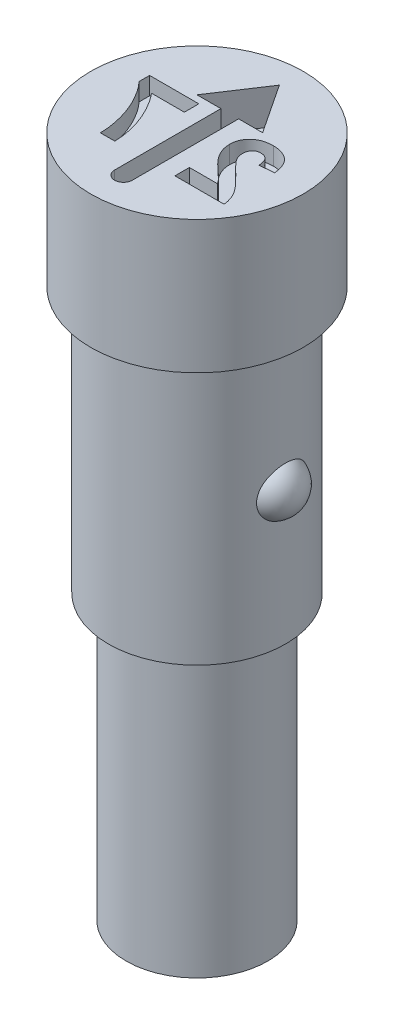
from build123d import *

# Parameters (mm, degrees)
CUT_EXTRUDE1_DEPTH = 0.4
CUT_EXTRUDE2_DEPTH = 0.2


with BuildPart() as part:
    # Sketch1 → Revolve1 (revolve)
    with BuildSketch(Plane.XY, mode=Mode.PRIVATE) as revolve1_sk:
        Polygon((0, 0), (-1.2, 0), (-1.2, -1.5), (-1, -1.5), (-1, -4.5), (-0.8, -4.5), (-0.8, -7.7), (0, -7.7), align=None)
    revolve(revolve1_sk.sketch.rotate(Axis((0, 0, 0), (0, -1, 0)), 270), axis=Axis((0, 0, 0), (0, -1, 0)))

    # Sketch3 → Cut-Extrude1 (cut)
    with BuildSketch(Plane(origin=(0, 0, 0), x_dir=(1, 0, 0), z_dir=(0, 1, 0))):
        with BuildLine():
            Line((0, 0.93), (-0.370655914, 0.37))
            Line((-0.370655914, 0.37), (-0.1, 0.37))
            Line((-0.1, 0.37), (-0.1, -0.83))
            ThreePointArc((-0.1, -0.83), (0, -0.93), (0.1, -0.83))
            Line((0.1, -0.83), (0.1, 0.37))
            Line((0.1, 0.37), (0.370655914, 0.37))
            Line((0.370655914, 0.37), (0, 0.93))
        make_face()
    extrude(amount=-CUT_EXTRUDE1_DEPTH, mode=Mode.SUBTRACT)

    # Sketch4 → Cut-Extrude2 (cut)
    with BuildSketch(Plane(origin=(0, 0, 0), x_dir=(1, 0, 0), z_dir=(0, 1, 0))):
        with BuildLine():
            Line((0.297249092, -0.383307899), (0.297249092, -0.546769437))
            Line((0.297249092, -0.546769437), (0.853018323, -0.546769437))
            add(Edge.make_bspline(
                [(0.853018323, -0.546769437), (0.851136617, -0.532799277), (0.847374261, -0.50486679), (0.835742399, -0.464064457), (0.820217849, -0.424248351), (0.803368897, -0.391847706), (0.786610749, -0.365766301), (0.771406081, -0.344394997), (0.753267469, -0.321656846), (0.732458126, -0.297368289), (0.709093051, -0.271453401), (0.682997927, -0.244008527), (0.654048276, -0.215165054), (0.633681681, -0.195578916), (0.623150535, -0.185451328)],
                knots=[0, 0, 0, 0, 1.156289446, 2.311930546, 3.473459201, 4.661751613, 5.303057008, 6.018253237, 6.81459331, 7.690699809, 8.644447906, 9.679642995, 10.800191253, 12, 12, 12, 12], degree=3))
            add(Edge.make_bspline(
                [(0.623150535, -0.185451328), (0.61474656, -0.177339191), (0.598747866, -0.161896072), (0.575965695, -0.139782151), (0.55593782, -0.119453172), (0.538245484, -0.101435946), (0.523297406, -0.085271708), (0.510896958, -0.071214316), (0.500887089, -0.059206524), (0.495465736, -0.051588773), (0.493062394, -0.048211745)],
                knots=[0, 0, 0, 0, 1.480720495, 2.818855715, 4.024636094, 5.098235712, 6.019786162, 6.815086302, 7.474715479, 8, 8, 8, 8], degree=3))
            add(Edge.make_bspline(
                [(0.493062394, -0.048211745), (0.488140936, -0.040036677), (0.478648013, -0.024267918), (0.468238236, 0.00052874), (0.461989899, 0.025320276), (0.461132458, 0.041885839), (0.460710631, 0.050035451)],
                knots=[0, 0, 0, 0, 1.0911822, 2.104764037, 3.067617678, 4, 4, 4, 4], degree=3))
            add(Edge.make_bspline(
                [(0.460710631, 0.050035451), (0.461016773, 0.058516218), (0.461595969, 0.074561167), (0.466452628, 0.097203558), (0.475065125, 0.116667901), (0.486922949, 0.133013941), (0.501917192, 0.145821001), (0.519445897, 0.155284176), (0.539765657, 0.160516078), (0.554047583, 0.161204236), (0.561511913, 0.161563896)],
                knots=[0, 0, 0, 0, 1.193122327, 2.257294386, 3.237245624, 4.168877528, 5.075331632, 5.990371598, 6.949684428, 8, 8, 8, 8], degree=3))
            add(Edge.make_bspline(
                [(0.561511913, 0.161563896), (0.568925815, 0.161228), (0.583247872, 0.160579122), (0.603602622, 0.154910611), (0.621409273, 0.145097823), (0.634099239, 0.133915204), (0.642671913, 0.123040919), (0.648513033, 0.113564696), (0.653547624, 0.102796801), (0.658008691, 0.090858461), (0.661532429, 0.077612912), (0.66437023, 0.063161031), (0.666657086, 0.047425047), (0.667384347, 0.036477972), (0.667761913, 0.030794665)],
                knots=[0, 0, 0, 0, 1.402788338, 2.709884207, 3.961032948, 5.225417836, 5.883680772, 6.578928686, 7.329201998, 8.132101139, 8.990263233, 9.922304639, 10.921339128, 12, 12, 12, 12], degree=3))
            Line((0.667761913, 0.030794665), (0.831223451, 0.046800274))
            add(Edge.make_bspline(
                [(0.831223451, 0.046800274), (0.829909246, 0.057835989), (0.827361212, 0.079232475), (0.821002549, 0.109965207), (0.812949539, 0.13831754), (0.802818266, 0.164236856), (0.791027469, 0.187887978), (0.776975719, 0.208916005), (0.761153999, 0.227553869), (0.743548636, 0.24379165), (0.724271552, 0.257681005), (0.704043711, 0.270079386), (0.682469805, 0.280249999), (0.659787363, 0.288632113), (0.636006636, 0.295331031), (0.611017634, 0.299760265), (0.584974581, 0.302875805), (0.567197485, 0.303110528), (0.558106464, 0.303230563)],
                knots=[0, 0, 0, 0, 1.270971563, 2.464210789, 3.586263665, 4.638946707, 5.643716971, 6.603612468, 7.52484387, 8.434700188, 9.336036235, 10.239171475, 11.145359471, 12.059630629, 13.003312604, 13.96741569, 14.960557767, 16, 16, 16, 16], degree=3))
            add(Edge.make_bspline(
                [(0.558106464, 0.303230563), (0.548223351, 0.303040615), (0.528974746, 0.302670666), (0.500875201, 0.299615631), (0.474477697, 0.294288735), (0.449551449, 0.287232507), (0.426352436, 0.277811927), (0.404687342, 0.266422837), (0.384897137, 0.252632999), (0.366686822, 0.237194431), (0.350408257, 0.220217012), (0.336149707, 0.202107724), (0.324203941, 0.182879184), (0.314179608, 0.162765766), (0.306736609, 0.141443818), (0.301313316, 0.119208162), (0.297717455, 0.095955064), (0.29740694, 0.080073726), (0.297249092, 0.072000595)],
                knots=[0, 0, 0, 0, 1.210756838, 2.35810096, 3.457354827, 4.507168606, 5.527358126, 6.519769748, 7.499700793, 8.476517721, 9.440526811, 10.376769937, 11.295256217, 12.209626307, 13.124630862, 14.055668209, 15.011616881, 16, 16, 16, 16], degree=3))
            add(Edge.make_bspline(
                [(0.297249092, 0.072000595), (0.297457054, 0.062735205), (0.297869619, 0.044354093), (0.301819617, 0.017181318), (0.307854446, -0.009364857), (0.316773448, -0.035349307), (0.328078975, -0.061395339), (0.342652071, -0.087561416), (0.359572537, -0.114636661), (0.372820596, -0.132141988), (0.379660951, -0.141180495)],
                knots=[0, 0, 0, 0, 0.953409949, 1.89141903, 2.821310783, 3.752688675, 4.715703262, 5.740811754, 6.833515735, 8, 8, 8, 8], degree=3))
            add(Edge.make_bspline(
                [(0.379660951, -0.141180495), (0.382246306, -0.144436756), (0.387783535, -0.151410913), (0.397203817, -0.162104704), (0.408121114, -0.173785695), (0.420381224, -0.186672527), (0.434389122, -0.200308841), (0.449640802, -0.2152649), (0.466807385, -0.230775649), (0.484587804, -0.247228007), (0.502445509, -0.263240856), (0.518859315, -0.278449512), (0.533768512, -0.291905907), (0.546478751, -0.304352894), (0.557737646, -0.314940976), (0.567139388, -0.324213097), (0.574859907, -0.331944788), (0.585498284, -0.343996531), (0.599034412, -0.36029652), (0.608557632, -0.375871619), (0.613104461, -0.383307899)],
                knots=[0, 0, 0, 0, 0.665555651, 1.425465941, 2.280616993, 3.225313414, 4.272635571, 5.410053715, 6.644756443, 7.976022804, 9.288331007, 10.484517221, 11.558462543, 12.503158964, 13.33222979, 14.032602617, 14.617328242, 15.080653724, 16.606167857, 18, 18, 18, 18], degree=3))
            Line((0.613104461, -0.383307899), (0.297249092, -0.383307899))
        make_face()
        with BuildLine():
            Line((-0.271597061, 0.128871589), (-0.271597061, 0.292333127))
            Line((-0.271597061, 0.292333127), (-0.827366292, 0.292333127))
            Line((-0.827366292, 0.292333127), (-0.827366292, 0.172461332))
            add(Edge.make_bspline(
                [(-0.827366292, 0.172461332), (-0.82156857, 0.166562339), (-0.809650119, 0.154435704), (-0.792578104, 0.13458926), (-0.775253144, 0.113052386), (-0.758037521, 0.089534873), (-0.740396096, 0.064408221), (-0.723104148, 0.037190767), (-0.705566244, 0.008235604), (-0.68195468, -0.032721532), (-0.654355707, -0.086224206), (-0.625157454, -0.152730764), (-0.60028188, -0.221279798), (-0.583248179, -0.279688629), (-0.571739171, -0.326503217), (-0.564219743, -0.360735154), (-0.55788998, -0.394003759), (-0.552740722, -0.426367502), (-0.548897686, -0.457841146), (-0.545861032, -0.488315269), (-0.544362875, -0.517864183), (-0.544141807, -0.537232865), (-0.544032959, -0.546769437)],
                knots=[0, 0, 0, 0, 0.628545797, 1.29210959, 1.98878689, 2.729126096, 3.507039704, 4.322017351, 5.179550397, 6.080149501, 7.915136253, 9.752312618, 11.597470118, 13.454141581, 14.373891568, 15.261584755, 16.117868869, 16.947726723, 17.752002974, 18.527724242, 19.275094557, 20, 20, 20, 20], degree=3))
            Line((-0.544032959, -0.546769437), (-0.38057142, -0.546769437))
            add(Edge.make_bspline(
                [(-0.38057142, -0.546769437), (-0.381117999, -0.532288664), (-0.382217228, -0.503166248), (-0.386329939, -0.459454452), (-0.392789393, -0.415579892), (-0.400812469, -0.371441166), (-0.41140493, -0.327145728), (-0.423494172, -0.282529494), (-0.438138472, -0.237830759), (-0.454554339, -0.193134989), (-0.472676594, -0.148866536), (-0.492427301, -0.10557447), (-0.513755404, -0.063528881), (-0.536383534, -0.022582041), (-0.560574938, 0.01713432), (-0.58634783, 0.055577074), (-0.613336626, 0.093024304), (-0.632633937, 0.116924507), (-0.642280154, 0.128871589)],
                knots=[0, 0, 0, 0, 0.943249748, 1.896978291, 2.856365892, 3.829648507, 4.816416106, 5.820376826, 6.838120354, 7.877341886, 8.919613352, 9.951365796, 10.974227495, 11.988073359, 12.996274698, 14.000568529, 15.000536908, 16, 16, 16, 16], degree=3))
            Line((-0.642280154, 0.128871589), (-0.271597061, 0.128871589))
        make_face()
    extrude(amount=-CUT_EXTRUDE2_DEPTH, mode=Mode.SUBTRACT)

    # Sketch5 → Revolve2 (revolve)
    with BuildSketch(Plane.XY):
        with BuildLine():
            Line((0.867853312, -2.7), (0.867853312, -3.3))
            ThreePointArc((0.867853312, -3.3), (1.167853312, -3), (0.867853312, -2.7))
        make_face()
    revolve(axis=Axis((0.867853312, -2.7, 0), (0, -1, 0)))


solid = part.part
